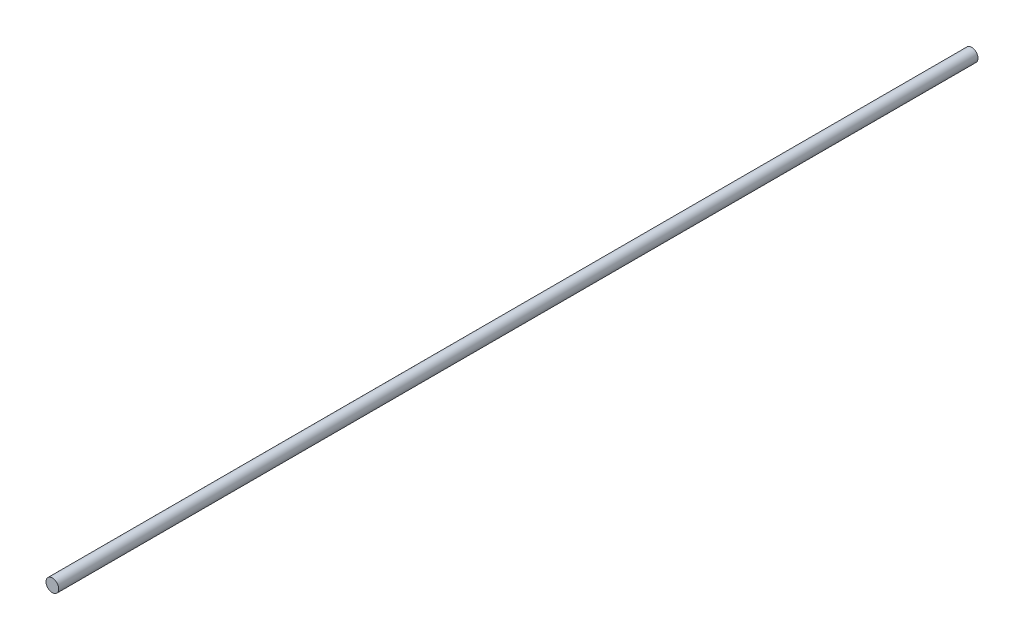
from build123d import *

# Parameters (mm, degrees)
SKETCH1_R          = 3.175
BASE_EXTRUDE_DEPTH = 457.2


with BuildPart() as part:
    # Sketch1 → Base-Extrude (new body)
    with BuildSketch(Plane.XY):
        Circle(SKETCH1_R)
    extrude(amount=BASE_EXTRUDE_DEPTH)


solid = part.part
